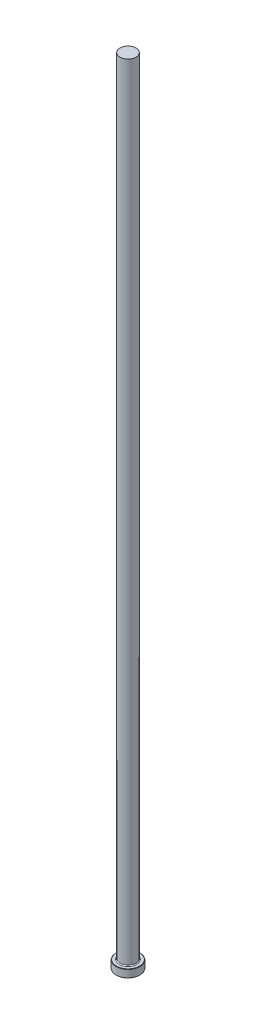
ISO-10303-21;
HEADER;
FILE_DESCRIPTION(('STEP AP214'),'2;1');
FILE_NAME('part.step','',(''),(''),'','','');
FILE_SCHEMA(('AUTOMOTIVE_DESIGN { 1 0 10303 214 1 1 1 1 }'));
ENDSEC;
DATA;
#1=APPLICATION_CONTEXT('core data for automotive mechanical design processes');
#2=APPLICATION_PROTOCOL_DEFINITION('international standard','automotive_design',2000,#1);
#3=PRODUCT_CONTEXT('',#1,'mechanical');
#4=PRODUCT('Part','Part','',(#3));
#5=PRODUCT_RELATED_PRODUCT_CATEGORY('part','',(#4));
#6=PRODUCT_DEFINITION_FORMATION('','',#4);
#7=PRODUCT_DEFINITION_CONTEXT('part definition',#1,'design');
#8=PRODUCT_DEFINITION('design','',#6,#7);
#9=PRODUCT_DEFINITION_SHAPE('','',#8);
#10=(LENGTH_UNIT() NAMED_UNIT(*) SI_UNIT(.MILLI.,.METRE.));
#11=(NAMED_UNIT(*) PLANE_ANGLE_UNIT() SI_UNIT($,.RADIAN.));
#12=(NAMED_UNIT(*) SI_UNIT($,.STERADIAN.) SOLID_ANGLE_UNIT());
#13=UNCERTAINTY_MEASURE_WITH_UNIT(LENGTH_MEASURE(1.E-05),#10,'distance_accuracy_value','');
#14=(GEOMETRIC_REPRESENTATION_CONTEXT(3) GLOBAL_UNCERTAINTY_ASSIGNED_CONTEXT((#13)) GLOBAL_UNIT_ASSIGNED_CONTEXT((#10,
#11,#12)) REPRESENTATION_CONTEXT('',''));
#15=CARTESIAN_POINT('',(0.,0.,0.));
#16=DIRECTION('',(0.,0.,1.));
#17=DIRECTION('',(1.,0.,0.));
#18=AXIS2_PLACEMENT_3D('',#15,#16,#17);
#19=CARTESIAN_POINT('',(0.,0.,0.));
#20=DIRECTION('',(0.,-1.,0.));
#21=DIRECTION('',(0.,0.,-1.));
#22=AXIS2_PLACEMENT_3D('',#19,#20,#21);
#23=PLANE('',#22);
#24=CARTESIAN_POINT('',(0.,0.,0.));
#25=DIRECTION('',(0.,-1.,0.));
#26=DIRECTION('',(0.,0.,-1.));
#27=AXIS2_PLACEMENT_3D('',#24,#25,#26);
#28=CIRCLE('',#27,9.27100000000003);
#29=CARTESIAN_POINT('',(0.,0.,-9.27100000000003));
#30=VERTEX_POINT('',#29);
#31=EDGE_CURVE('E41',#30,#30,#28,.T.);
#32=ORIENTED_EDGE('',*,*,#31,.T.);
#33=EDGE_LOOP('',(#32));
#34=FACE_BOUND('',#33,.T.);
#35=ADVANCED_FACE('F30',(#34),#23,.T.);
#36=CARTESIAN_POINT('',(0.,259.958771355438,0.));
#37=DIRECTION('',(0.,1.,0.));
#38=DIRECTION('',(0.,0.,1.));
#39=AXIS2_PLACEMENT_3D('',#36,#37,#38);
#40=CYLINDRICAL_SURFACE('',#39,9.52499999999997);
#41=CARTESIAN_POINT('',(0.,6.0960000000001,0.));
#42=DIRECTION('',(0.,1.,0.));
#43=DIRECTION('',(0.,0.,1.));
#44=AXIS2_PLACEMENT_3D('',#41,#42,#43);
#45=CIRCLE('',#44,9.52499999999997);
#46=CARTESIAN_POINT('',(0.,6.0960000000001,9.52499999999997));
#47=VERTEX_POINT('',#46);
#48=EDGE_CURVE('E45',#47,#47,#45,.F.);
#49=ORIENTED_EDGE('',*,*,#48,.T.);
#50=EDGE_LOOP('',(#49));
#51=FACE_BOUND('',#50,.T.);
#52=CARTESIAN_POINT('',(0.,0.253999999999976,0.));
#53=DIRECTION('',(0.,-1.,0.));
#54=DIRECTION('',(0.,0.,-1.));
#55=AXIS2_PLACEMENT_3D('',#52,#53,#54);
#56=CIRCLE('',#55,9.52499999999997);
#57=CARTESIAN_POINT('',(0.,0.253999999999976,-9.52499999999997));
#58=VERTEX_POINT('',#57);
#59=EDGE_CURVE('E50',#58,#58,#56,.F.);
#60=ORIENTED_EDGE('',*,*,#59,.T.);
#61=EDGE_LOOP('',(#60));
#62=FACE_BOUND('',#61,.T.);
#63=ADVANCED_FACE('F72',(#51,#62),#40,.T.);
#64=CARTESIAN_POINT('',(-9.52499999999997,6.35,0.));
#65=DIRECTION('',(0.,1.,0.));
#66=DIRECTION('',(0.,0.,1.));
#67=AXIS2_PLACEMENT_3D('',#64,#65,#66);
#68=PLANE('',#67);
#69=CARTESIAN_POINT('',(0.,6.35,0.));
#70=DIRECTION('',(0.,1.,0.));
#71=DIRECTION('',(0.,0.,1.));
#72=AXIS2_PLACEMENT_3D('',#69,#70,#71);
#73=CIRCLE('',#72,7.17549999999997);
#74=CARTESIAN_POINT('',(0.,6.35,7.17549999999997));
#75=VERTEX_POINT('',#74);
#76=EDGE_CURVE('E10',#75,#75,#73,.F.);
#77=ORIENTED_EDGE('',*,*,#76,.T.);
#78=EDGE_LOOP('',(#77));
#79=FACE_BOUND('',#78,.T.);
#80=CARTESIAN_POINT('',(0.,6.35,0.));
#81=DIRECTION('',(0.,1.,0.));
#82=DIRECTION('',(0.,0.,1.));
#83=AXIS2_PLACEMENT_3D('',#80,#81,#82);
#84=CIRCLE('',#83,9.27100000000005);
#85=CARTESIAN_POINT('',(0.,6.35,9.27100000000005));
#86=VERTEX_POINT('',#85);
#87=EDGE_CURVE('E53',#86,#86,#84,.T.);
#88=ORIENTED_EDGE('',*,*,#87,.T.);
#89=EDGE_LOOP('',(#88));
#90=FACE_BOUND('',#89,.T.);
#91=ADVANCED_FACE('F64',(#79,#90),#68,.T.);
#92=CARTESIAN_POINT('',(0.,259.958771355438,0.));
#93=DIRECTION('',(0.,1.,0.));
#94=DIRECTION('',(0.,0.,1.));
#95=AXIS2_PLACEMENT_3D('',#92,#93,#94);
#96=CYLINDRICAL_SURFACE('',#95,6.41349999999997);
#97=CARTESIAN_POINT('',(0.,7.11200000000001,0.));
#98=DIRECTION('',(0.,1.,0.));
#99=DIRECTION('',(0.,0.,1.));
#100=AXIS2_PLACEMENT_3D('',#97,#98,#99);
#101=CIRCLE('',#100,6.41349999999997);
#102=CARTESIAN_POINT('',(0.,7.11200000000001,6.41349999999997));
#103=VERTEX_POINT('',#102);
#104=EDGE_CURVE('E37',#103,#103,#101,.T.);
#105=ORIENTED_EDGE('',*,*,#104,.T.);
#106=EDGE_LOOP('',(#105));
#107=FACE_BOUND('',#106,.T.);
#108=CARTESIAN_POINT('',(0.,635.,0.));
#109=DIRECTION('',(0.,1.,0.));
#110=DIRECTION('',(0.,0.,1.));
#111=AXIS2_PLACEMENT_3D('',#108,#109,#110);
#112=CIRCLE('',#111,6.41349999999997);
#113=CARTESIAN_POINT('',(0.,635.,6.41349999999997));
#114=VERTEX_POINT('',#113);
#115=EDGE_CURVE('E56',#114,#114,#112,.T.);
#116=ORIENTED_EDGE('',*,*,#115,.F.);
#117=EDGE_LOOP('',(#116));
#118=FACE_BOUND('',#117,.T.);
#119=ADVANCED_FACE('F62',(#107,#118),#96,.T.);
#120=CARTESIAN_POINT('',(-6.41349999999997,635.,0.));
#121=DIRECTION('',(0.,1.,0.));
#122=DIRECTION('',(0.,0.,1.));
#123=AXIS2_PLACEMENT_3D('',#120,#121,#122);
#124=PLANE('',#123);
#125=ORIENTED_EDGE('',*,*,#115,.T.);
#126=EDGE_LOOP('',(#125));
#127=FACE_BOUND('',#126,.T.);
#128=ADVANCED_FACE('F60',(#127),#124,.T.);
#129=CARTESIAN_POINT('',(0.,6.35000000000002,0.));
#130=DIRECTION('',(0.,-1.,0.));
#131=DIRECTION('',(0.,0.,-1.));
#132=AXIS2_PLACEMENT_3D('',#129,#130,#131);
#133=CONICAL_SURFACE('',#132,9.27100000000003,0.785398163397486);
#134=ORIENTED_EDGE('',*,*,#48,.F.);
#135=EDGE_LOOP('',(#134));
#136=FACE_BOUND('',#135,.T.);
#137=ORIENTED_EDGE('',*,*,#87,.F.);
#138=EDGE_LOOP('',(#137));
#139=FACE_BOUND('',#138,.T.);
#140=ADVANCED_FACE('F70',(#136,#139),#133,.T.);
#141=CARTESIAN_POINT('',(0.,0.253999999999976,0.));
#142=DIRECTION('',(0.,1.,0.));
#143=DIRECTION('',(0.,0.,1.));
#144=AXIS2_PLACEMENT_3D('',#141,#142,#143);
#145=CONICAL_SURFACE('',#144,9.52499999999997,0.785398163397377);
#146=ORIENTED_EDGE('',*,*,#31,.F.);
#147=EDGE_LOOP('',(#146));
#148=FACE_BOUND('',#147,.T.);
#149=ORIENTED_EDGE('',*,*,#59,.F.);
#150=EDGE_LOOP('',(#149));
#151=FACE_BOUND('',#150,.T.);
#152=ADVANCED_FACE('F84',(#148,#151),#145,.T.);
#153=CARTESIAN_POINT('',(0.,7.11200000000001,0.));
#154=DIRECTION('',(0.,1.,0.));
#155=DIRECTION('',(0.,0.,1.));
#156=AXIS2_PLACEMENT_3D('',#153,#154,#155);
#157=TOROIDAL_SURFACE('',#156,7.17549999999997,0.762);
#158=ORIENTED_EDGE('',*,*,#76,.F.);
#159=EDGE_LOOP('',(#158));
#160=FACE_BOUND('',#159,.T.);
#161=ORIENTED_EDGE('',*,*,#104,.F.);
#162=EDGE_LOOP('',(#161));
#163=FACE_BOUND('',#162,.T.);
#164=ADVANCED_FACE('F32',(#160,#163),#157,.F.);
#165=CLOSED_SHELL('',(#35,#63,#91,#119,#128,#140,#152,#164));
#166=MANIFOLD_SOLID_BREP('B2',#165);
#167=ADVANCED_BREP_SHAPE_REPRESENTATION('',(#18,#166),#14);
#168=SHAPE_DEFINITION_REPRESENTATION(#9,#167);
ENDSEC;
END-ISO-10303-21;
